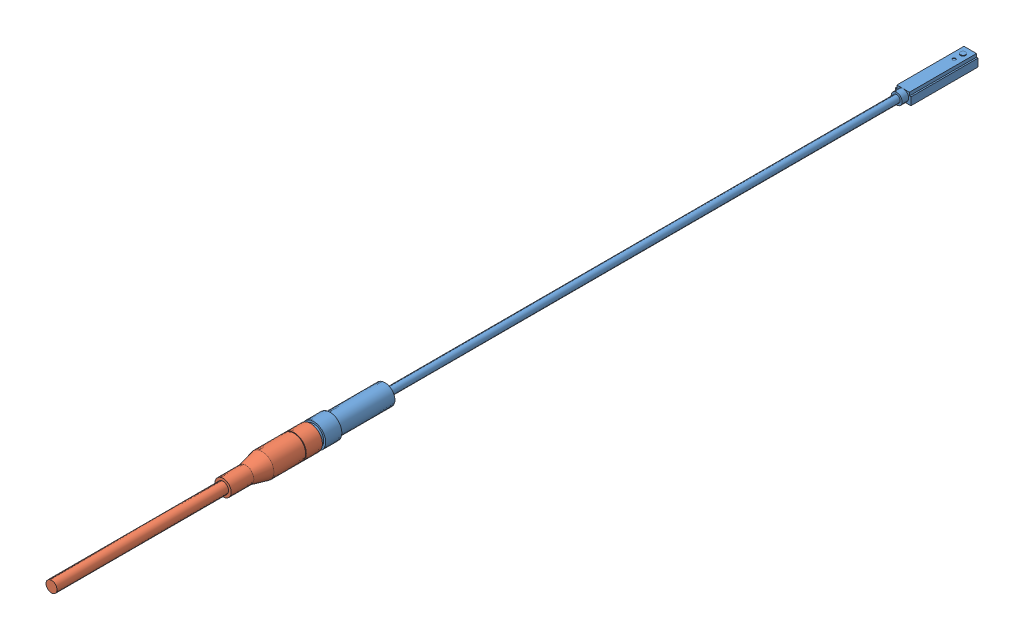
SolidWorks assembly ilc62297001.sldasm, configuration Default (file format 3400). Lengths in mm.
Overall size (9.4 9.4 360.43).
2 component instances, 2 part files, 3 mates.
Components (placement in the parent):
- ilc62297001_29700101-2: ilc62297001_29700101.SLDPRT [Default] at origin size (9.4 9.4 263.91)
- ilc62297001_27642400-2: ilc62297001_27642400.SLDPRT [Default] at (0 2.159 258.826) size (9.4 9.4 101.6)
Mates (geometry in assembly coordinates):
- Concentric1: concentric aligned: cylinder of ilc62297001_29700101-2; cylinder of ilc62297001_27642400-2
- Concentric2: concentric anti-aligned: cylinder of ilc62297001_29700101-2; cylinder of ilc62297001_27642400-2
- Coincident1: coincident anti-aligned: plane of ilc62297001_29700101-2 through (0 2.159 258.826) normal (0 0 1); plane of ilc62297001_27642400-2 through (0 2.159 258.826) normal (0 0 -1)
